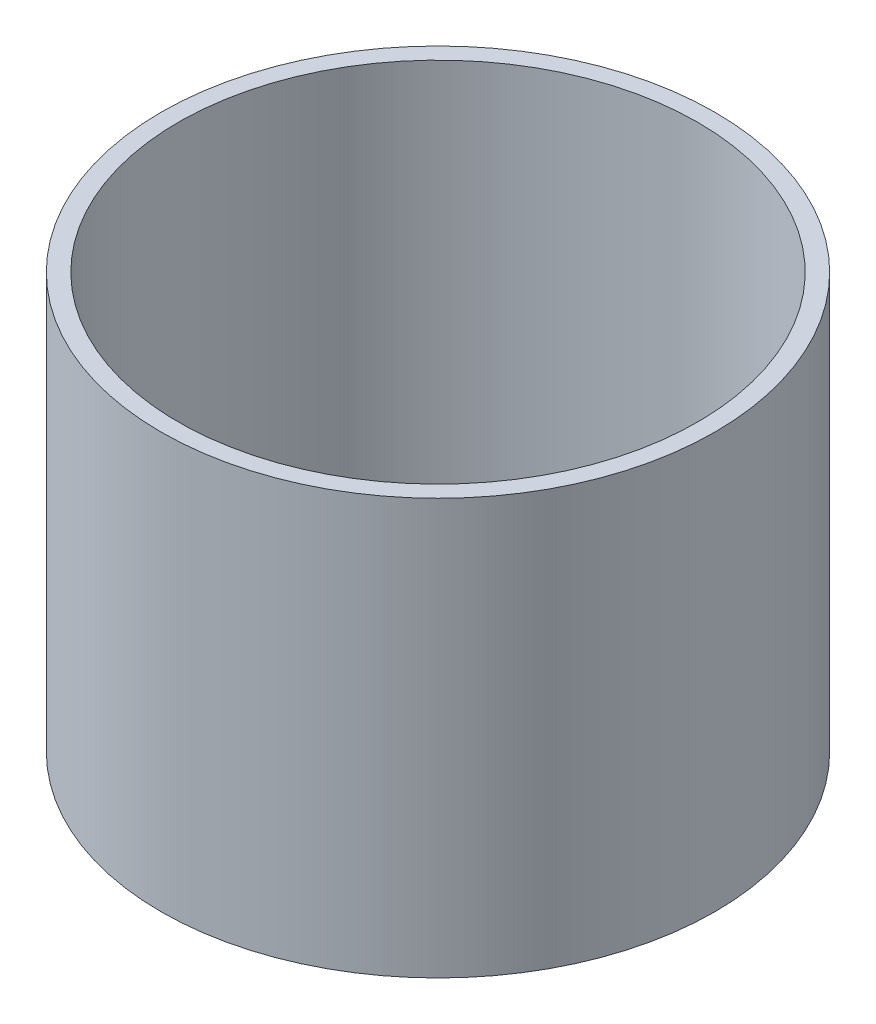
ISO-10303-21;
HEADER;
FILE_DESCRIPTION(('STEP AP214'),'2;1');
FILE_NAME('part.step','',(''),(''),'','','');
FILE_SCHEMA(('AUTOMOTIVE_DESIGN { 1 0 10303 214 1 1 1 1 }'));
ENDSEC;
DATA;
#1=APPLICATION_CONTEXT('core data for automotive mechanical design processes');
#2=APPLICATION_PROTOCOL_DEFINITION('international standard','automotive_design',2000,#1);
#3=PRODUCT_CONTEXT('',#1,'mechanical');
#4=PRODUCT('Part','Part','',(#3));
#5=PRODUCT_RELATED_PRODUCT_CATEGORY('part','',(#4));
#6=PRODUCT_DEFINITION_FORMATION('','',#4);
#7=PRODUCT_DEFINITION_CONTEXT('part definition',#1,'design');
#8=PRODUCT_DEFINITION('design','',#6,#7);
#9=PRODUCT_DEFINITION_SHAPE('','',#8);
#10=(LENGTH_UNIT() NAMED_UNIT(*) SI_UNIT(.MILLI.,.METRE.));
#11=(NAMED_UNIT(*) PLANE_ANGLE_UNIT() SI_UNIT($,.RADIAN.));
#12=(NAMED_UNIT(*) SI_UNIT($,.STERADIAN.) SOLID_ANGLE_UNIT());
#13=UNCERTAINTY_MEASURE_WITH_UNIT(LENGTH_MEASURE(1.E-05),#10,'distance_accuracy_value','');
#14=(GEOMETRIC_REPRESENTATION_CONTEXT(3) GLOBAL_UNCERTAINTY_ASSIGNED_CONTEXT((#13)) GLOBAL_UNIT_ASSIGNED_CONTEXT((#10,
#11,#12)) REPRESENTATION_CONTEXT('',''));
#15=CARTESIAN_POINT('',(0.,0.,0.));
#16=DIRECTION('',(0.,0.,1.));
#17=DIRECTION('',(1.,0.,0.));
#18=AXIS2_PLACEMENT_3D('',#15,#16,#17);
#19=CARTESIAN_POINT('',(-40.,0.,0.));
#20=DIRECTION('',(0.,1.,0.));
#21=DIRECTION('',(0.,0.,1.));
#22=AXIS2_PLACEMENT_3D('',#19,#20,#21);
#23=PLANE('',#22);
#24=CARTESIAN_POINT('',(0.,0.,0.));
#25=DIRECTION('',(0.,-1.,0.));
#26=DIRECTION('',(0.,0.,-1.));
#27=AXIS2_PLACEMENT_3D('',#24,#25,#26);
#28=CIRCLE('',#27,37.5);
#29=CARTESIAN_POINT('',(0.,0.,-37.5));
#30=VERTEX_POINT('',#29);
#31=EDGE_CURVE('E10',#30,#30,#28,.T.);
#32=ORIENTED_EDGE('',*,*,#31,.F.);
#33=EDGE_LOOP('',(#32));
#34=FACE_BOUND('',#33,.T.);
#35=CARTESIAN_POINT('',(0.,0.,0.));
#36=DIRECTION('',(0.,-1.,0.));
#37=DIRECTION('',(0.,0.,-1.));
#38=AXIS2_PLACEMENT_3D('',#35,#36,#37);
#39=CIRCLE('',#38,40.);
#40=CARTESIAN_POINT('',(0.,0.,-40.));
#41=VERTEX_POINT('',#40);
#42=EDGE_CURVE('E42',#41,#41,#39,.T.);
#43=ORIENTED_EDGE('',*,*,#42,.T.);
#44=EDGE_LOOP('',(#43));
#45=FACE_BOUND('',#44,.T.);
#46=ADVANCED_FACE('F28',(#34,#45),#23,.F.);
#47=CARTESIAN_POINT('',(0.,0.,0.));
#48=DIRECTION('',(0.,-1.,0.));
#49=DIRECTION('',(0.,0.,-1.));
#50=AXIS2_PLACEMENT_3D('',#47,#48,#49);
#51=CYLINDRICAL_SURFACE('',#50,37.5);
#52=CARTESIAN_POINT('',(0.,60.,0.));
#53=DIRECTION('',(0.,-1.,0.));
#54=DIRECTION('',(0.,0.,-1.));
#55=AXIS2_PLACEMENT_3D('',#52,#53,#54);
#56=CIRCLE('',#55,37.5);
#57=CARTESIAN_POINT('',(0.,60.,-37.5));
#58=VERTEX_POINT('',#57);
#59=EDGE_CURVE('E34',#58,#58,#56,.T.);
#60=ORIENTED_EDGE('',*,*,#59,.F.);
#61=EDGE_LOOP('',(#60));
#62=FACE_BOUND('',#61,.T.);
#63=ORIENTED_EDGE('',*,*,#31,.T.);
#64=EDGE_LOOP('',(#63));
#65=FACE_BOUND('',#64,.T.);
#66=ADVANCED_FACE('F57',(#62,#65),#51,.F.);
#67=CARTESIAN_POINT('',(-37.5,60.,0.));
#68=DIRECTION('',(0.,-1.,0.));
#69=DIRECTION('',(0.,0.,-1.));
#70=AXIS2_PLACEMENT_3D('',#67,#68,#69);
#71=PLANE('',#70);
#72=CARTESIAN_POINT('',(0.,60.,0.));
#73=DIRECTION('',(0.,-1.,0.));
#74=DIRECTION('',(0.,0.,-1.));
#75=AXIS2_PLACEMENT_3D('',#72,#73,#74);
#76=CIRCLE('',#75,40.);
#77=CARTESIAN_POINT('',(0.,60.,-40.));
#78=VERTEX_POINT('',#77);
#79=EDGE_CURVE('E38',#78,#78,#76,.T.);
#80=ORIENTED_EDGE('',*,*,#79,.F.);
#81=EDGE_LOOP('',(#80));
#82=FACE_BOUND('',#81,.T.);
#83=ORIENTED_EDGE('',*,*,#59,.T.);
#84=EDGE_LOOP('',(#83));
#85=FACE_BOUND('',#84,.T.);
#86=ADVANCED_FACE('F52',(#82,#85),#71,.F.);
#87=CARTESIAN_POINT('',(0.,0.,0.));
#88=DIRECTION('',(0.,-1.,0.));
#89=DIRECTION('',(0.,0.,-1.));
#90=AXIS2_PLACEMENT_3D('',#87,#88,#89);
#91=CYLINDRICAL_SURFACE('',#90,40.);
#92=ORIENTED_EDGE('',*,*,#42,.F.);
#93=EDGE_LOOP('',(#92));
#94=FACE_BOUND('',#93,.T.);
#95=ORIENTED_EDGE('',*,*,#79,.T.);
#96=EDGE_LOOP('',(#95));
#97=FACE_BOUND('',#96,.T.);
#98=ADVANCED_FACE('F49',(#94,#97),#91,.T.);
#99=CLOSED_SHELL('',(#46,#66,#86,#98));
#100=MANIFOLD_SOLID_BREP('B2',#99);
#101=ADVANCED_BREP_SHAPE_REPRESENTATION('',(#18,#100),#14);
#102=SHAPE_DEFINITION_REPRESENTATION(#9,#101);
ENDSEC;
END-ISO-10303-21;
